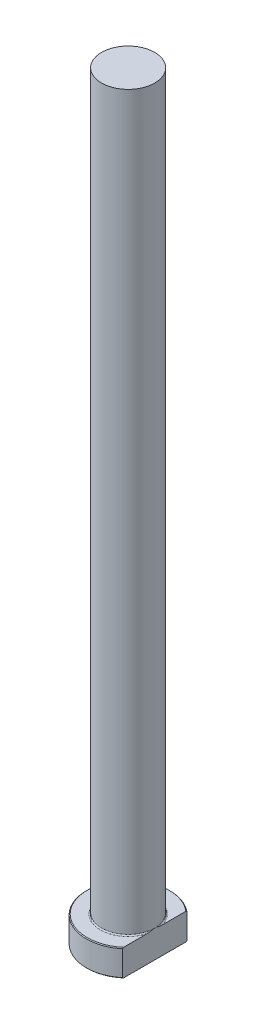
ISO-10303-21;
HEADER;
FILE_DESCRIPTION(('STEP AP214'),'2;1');
FILE_NAME('part.step','',(''),(''),'','','');
FILE_SCHEMA(('AUTOMOTIVE_DESIGN { 1 0 10303 214 1 1 1 1 }'));
ENDSEC;
DATA;
#1=APPLICATION_CONTEXT('core data for automotive mechanical design processes');
#2=APPLICATION_PROTOCOL_DEFINITION('international standard','automotive_design',2000,#1);
#3=PRODUCT_CONTEXT('',#1,'mechanical');
#4=PRODUCT('Part','Part','',(#3));
#5=PRODUCT_RELATED_PRODUCT_CATEGORY('part','',(#4));
#6=PRODUCT_DEFINITION_FORMATION('','',#4);
#7=PRODUCT_DEFINITION_CONTEXT('part definition',#1,'design');
#8=PRODUCT_DEFINITION('design','',#6,#7);
#9=PRODUCT_DEFINITION_SHAPE('','',#8);
#10=(LENGTH_UNIT() NAMED_UNIT(*) SI_UNIT(.MILLI.,.METRE.));
#11=(NAMED_UNIT(*) PLANE_ANGLE_UNIT() SI_UNIT($,.RADIAN.));
#12=(NAMED_UNIT(*) SI_UNIT($,.STERADIAN.) SOLID_ANGLE_UNIT());
#13=UNCERTAINTY_MEASURE_WITH_UNIT(LENGTH_MEASURE(1.E-05),#10,'distance_accuracy_value','');
#14=(GEOMETRIC_REPRESENTATION_CONTEXT(3) GLOBAL_UNCERTAINTY_ASSIGNED_CONTEXT((#13)) GLOBAL_UNIT_ASSIGNED_CONTEXT((#10,
#11,#12)) REPRESENTATION_CONTEXT('',''));
#15=CARTESIAN_POINT('',(0.,0.,0.));
#16=DIRECTION('',(0.,0.,1.));
#17=DIRECTION('',(1.,0.,0.));
#18=AXIS2_PLACEMENT_3D('',#15,#16,#17);
#19=CARTESIAN_POINT('',(0.,0.,0.));
#20=DIRECTION('',(0.,-1.,0.));
#21=DIRECTION('',(0.,0.,-1.));
#22=AXIS2_PLACEMENT_3D('',#19,#20,#21);
#23=PLANE('',#22);
#24=CARTESIAN_POINT('',(0.,0.,0.));
#25=DIRECTION('',(0.,-1.,0.));
#26=DIRECTION('',(0.,0.,-1.));
#27=AXIS2_PLACEMENT_3D('',#24,#25,#26);
#28=CIRCLE('',#27,10.7999999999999);
#29=CARTESIAN_POINT('',(6.99999999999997,0.,8.2243540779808));
#30=VERTEX_POINT('',#29);
#31=CARTESIAN_POINT('',(6.99999999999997,0.,-8.2243540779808));
#32=VERTEX_POINT('',#31);
#33=EDGE_CURVE('E98',#30,#32,#28,.T.);
#34=ORIENTED_EDGE('',*,*,#33,.T.);
#35=DIRECTION('',(0.,0.,1.));
#36=VECTOR('',#35,1.);
#37=CARTESIAN_POINT('',(6.99999999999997,0.,-8.48528137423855));
#38=LINE('',#37,#36);
#39=EDGE_CURVE('E83',#32,#30,#38,.T.);
#40=ORIENTED_EDGE('',*,*,#39,.T.);
#41=EDGE_LOOP('',(#34,#40));
#42=FACE_BOUND('',#41,.T.);
#43=ADVANCED_FACE('F32',(#42),#23,.T.);
#44=CARTESIAN_POINT('',(0.,259.958771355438,0.));
#45=DIRECTION('',(0.,1.,0.));
#46=DIRECTION('',(0.,0.,1.));
#47=AXIS2_PLACEMENT_3D('',#44,#45,#46);
#48=CYLINDRICAL_SURFACE('',#47,11.);
#49=CARTESIAN_POINT('',(0.,6.79999999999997,0.));
#50=DIRECTION('',(0.,1.,0.));
#51=DIRECTION('',(0.,0.,1.));
#52=AXIS2_PLACEMENT_3D('',#49,#50,#51);
#53=CIRCLE('',#52,11.);
#54=CARTESIAN_POINT('',(6.99999999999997,6.79999999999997,8.48528137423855));
#55=VERTEX_POINT('',#54);
#56=CARTESIAN_POINT('',(6.99999999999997,6.79999999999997,-8.48528137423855));
#57=VERTEX_POINT('',#56);
#58=EDGE_CURVE('E104',#55,#57,#53,.F.);
#59=ORIENTED_EDGE('',*,*,#58,.T.);
#60=DIRECTION('',(0.,-1.,0.));
#61=VECTOR('',#60,1.);
#62=CARTESIAN_POINT('',(6.99999999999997,200.,-8.48528137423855));
#63=LINE('',#62,#61);
#64=CARTESIAN_POINT('',(6.99999999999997,0.200000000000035,-8.48528137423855));
#65=VERTEX_POINT('',#64);
#66=EDGE_CURVE('E183',#57,#65,#63,.T.);
#67=ORIENTED_EDGE('',*,*,#66,.T.);
#68=CARTESIAN_POINT('',(0.,0.200000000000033,0.));
#69=DIRECTION('',(0.,-1.,0.));
#70=DIRECTION('',(0.,0.,-1.));
#71=AXIS2_PLACEMENT_3D('',#68,#69,#70);
#72=CIRCLE('',#71,11.);
#73=CARTESIAN_POINT('',(6.99999999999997,0.200000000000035,8.48528137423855));
#74=VERTEX_POINT('',#73);
#75=EDGE_CURVE('E100',#65,#74,#72,.F.);
#76=ORIENTED_EDGE('',*,*,#75,.T.);
#77=DIRECTION('',(0.,-1.,0.));
#78=VECTOR('',#77,1.);
#79=CARTESIAN_POINT('',(6.99999999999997,200.,8.48528137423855));
#80=LINE('',#79,#78);
#81=EDGE_CURVE('E93',#55,#74,#80,.T.);
#82=ORIENTED_EDGE('',*,*,#81,.F.);
#83=EDGE_LOOP('',(#59,#67,#76,#82));
#84=FACE_BOUND('',#83,.T.);
#85=ADVANCED_FACE('F158',(#84),#48,.T.);
#86=CARTESIAN_POINT('',(-11.,7.,0.));
#87=DIRECTION('',(0.,1.,0.));
#88=DIRECTION('',(0.,0.,1.));
#89=AXIS2_PLACEMENT_3D('',#86,#87,#88);
#90=PLANE('',#89);
#91=CARTESIAN_POINT('',(0.,7.,0.));
#92=DIRECTION('',(0.,1.,0.));
#93=DIRECTION('',(0.,0.,1.));
#94=AXIS2_PLACEMENT_3D('',#91,#92,#93);
#95=CIRCLE('',#94,10.8);
#96=CARTESIAN_POINT('',(6.99999999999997,7.,-8.2243540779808));
#97=VERTEX_POINT('',#96);
#98=CARTESIAN_POINT('',(6.99999999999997,7.,8.2243540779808));
#99=VERTEX_POINT('',#98);
#100=EDGE_CURVE('E178',#97,#99,#95,.T.);
#101=ORIENTED_EDGE('',*,*,#100,.T.);
#102=DIRECTION('',(0.,0.,-1.));
#103=VECTOR('',#102,1.);
#104=CARTESIAN_POINT('',(6.99999999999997,7.,0.));
#105=LINE('',#104,#103);
#106=CARTESIAN_POINT('',(6.99999999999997,6.99999999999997,2.07123151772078));
#107=VERTEX_POINT('',#106);
#108=EDGE_CURVE('E57',#99,#107,#105,.T.);
#109=ORIENTED_EDGE('',*,*,#108,.T.);
#110=CARTESIAN_POINT('',(0.,7.,0.));
#111=DIRECTION('',(0.,1.,0.));
#112=DIRECTION('',(0.,0.,1.));
#113=AXIS2_PLACEMENT_3D('',#110,#111,#112);
#114=CIRCLE('',#113,7.29999999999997);
#115=CARTESIAN_POINT('',(6.99999999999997,6.99999999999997,-2.07123151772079));
#116=VERTEX_POINT('',#115);
#117=EDGE_CURVE('E107',#107,#116,#114,.F.);
#118=ORIENTED_EDGE('',*,*,#117,.T.);
#119=EDGE_CURVE('E136',#116,#97,#105,.T.);
#120=ORIENTED_EDGE('',*,*,#119,.T.);
#121=EDGE_LOOP('',(#101,#109,#118,#120));
#122=FACE_BOUND('',#121,.T.);
#123=ADVANCED_FACE('F147',(#122),#90,.T.);
#124=CARTESIAN_POINT('',(0.,7.00000000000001,0.));
#125=DIRECTION('',(0.,-1.,0.));
#126=DIRECTION('',(0.,0.,-1.));
#127=AXIS2_PLACEMENT_3D('',#124,#125,#126);
#128=CONICAL_SURFACE('',#127,10.7999999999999,0.785398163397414);
#129=ORIENTED_EDGE('',*,*,#58,.F.);
#130=CARTESIAN_POINT('',(6.99999999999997,-2.13774979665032,18.6685261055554));
#131=CARTESIAN_POINT('',(6.99999999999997,-1.8657487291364,18.3780244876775));
#132=CARTESIAN_POINT('',(6.99999999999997,-1.59415659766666,18.0871392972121));
#133=CARTESIAN_POINT('',(6.99999999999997,-1.05192877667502,17.5044755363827));
#134=CARTESIAN_POINT('',(6.99999999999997,-0.781293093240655,17.2126969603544));
#135=CARTESIAN_POINT('',(6.99999999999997,-0.241050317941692,16.628048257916));
#136=CARTESIAN_POINT('',(6.99999999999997,0.0285564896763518,16.3351778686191));
#137=CARTESIAN_POINT('',(6.99999999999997,0.566485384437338,15.7482616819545));
#138=CARTESIAN_POINT('',(6.99999999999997,0.834807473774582,15.4542158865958));
#139=CARTESIAN_POINT('',(6.99999999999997,1.64198377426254,14.5651645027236));
#140=CARTESIAN_POINT('',(6.99999999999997,2.17856420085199,13.9680841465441));
#141=CARTESIAN_POINT('',(6.99999999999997,2.97696333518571,13.06681441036));
#142=CARTESIAN_POINT('',(6.99999999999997,3.24199785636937,12.7654727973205));
#143=CARTESIAN_POINT('',(6.99999999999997,3.76945856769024,12.1605141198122));
#144=CARTESIAN_POINT('',(6.99999999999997,4.03188476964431,11.8568970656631));
#145=CARTESIAN_POINT('',(6.99999999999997,4.50733797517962,11.3009625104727));
#146=CARTESIAN_POINT('',(6.99999999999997,4.7208802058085,11.0490858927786));
#147=CARTESIAN_POINT('',(6.99999999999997,5.14538078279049,10.5431655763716));
#148=CARTESIAN_POINT('',(6.99999999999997,5.35633915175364,10.2891218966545));
#149=CARTESIAN_POINT('',(6.99999999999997,5.77522964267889,9.7783673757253));
#150=CARTESIAN_POINT('',(6.99999999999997,5.98316044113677,9.52165544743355));
#151=CARTESIAN_POINT('',(6.99999999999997,6.39521098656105,9.00519084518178));
#152=CARTESIAN_POINT('',(6.99999999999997,6.59933078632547,8.74543821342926));
#153=CARTESIAN_POINT('',(6.99999999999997,7.00243445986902,8.22283607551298));
#154=CARTESIAN_POINT('',(6.99999999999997,7.20142819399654,7.95999419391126));
#155=CARTESIAN_POINT('',(6.99999999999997,7.59353840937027,7.42991856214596));
#156=CARTESIAN_POINT('',(6.99999999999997,7.78665447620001,7.16268450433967));
#157=CARTESIAN_POINT('',(6.99999999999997,8.16523718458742,6.62311113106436));
#158=CARTESIAN_POINT('',(6.99999999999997,8.35070911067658,6.35077553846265));
#159=CARTESIAN_POINT('',(6.99999999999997,8.71189725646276,5.7997373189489));
#160=CARTESIAN_POINT('',(6.99999999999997,8.88761537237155,5.5210359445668));
#161=CARTESIAN_POINT('',(6.99999999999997,9.19554959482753,5.00707921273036));
#162=CARTESIAN_POINT('',(6.99999999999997,9.3298807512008,4.77309669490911));
#163=CARTESIAN_POINT('',(6.99999999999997,9.58764253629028,4.29911523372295));
#164=CARTESIAN_POINT('',(6.99999999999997,9.71107181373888,4.05911554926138));
#165=CARTESIAN_POINT('',(6.99999999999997,9.94390907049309,3.57263619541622));
#166=CARTESIAN_POINT('',(6.99999999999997,10.0533307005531,3.3261631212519));
#167=CARTESIAN_POINT('',(6.99999999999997,10.2545146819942,2.82607166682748));
#168=CARTESIAN_POINT('',(6.99999999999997,10.3462820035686,2.57245532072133));
#169=CARTESIAN_POINT('',(6.99999999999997,10.4907049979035,2.11254447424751));
#170=CARTESIAN_POINT('',(6.99999999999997,10.5475277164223,1.90756611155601));
#171=CARTESIAN_POINT('',(6.99999999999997,10.6452043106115,1.49381161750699));
#172=CARTESIAN_POINT('',(6.99999999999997,10.68606033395,1.2850360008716));
#173=CARTESIAN_POINT('',(6.99999999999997,10.749755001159,0.865342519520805));
#174=CARTESIAN_POINT('',(6.99999999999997,10.772646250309,0.654432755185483));
#175=CARTESIAN_POINT('',(6.99999999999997,10.7993569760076,0.231396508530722));
#176=CARTESIAN_POINT('',(6.99999999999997,10.8031771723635,0.0192700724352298));
#177=CARTESIAN_POINT('',(6.99999999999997,10.7915178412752,-0.404715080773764));
#178=CARTESIAN_POINT('',(6.99999999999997,10.7760135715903,-0.616573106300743));
#179=CARTESIAN_POINT('',(6.99999999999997,10.7265413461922,-1.03810446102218));
#180=CARTESIAN_POINT('',(6.99999999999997,10.6925718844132,-1.24777761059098));
#181=CARTESIAN_POINT('',(6.99999999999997,10.6077703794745,-1.66430273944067));
#182=CARTESIAN_POINT('',(6.99999999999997,10.5568873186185,-1.87114418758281));
#183=CARTESIAN_POINT('',(6.99999999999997,10.4404729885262,-2.28061279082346));
#184=CARTESIAN_POINT('',(6.99999999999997,10.3749414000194,-2.48323985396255));
#185=CARTESIAN_POINT('',(6.99999999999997,10.2190980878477,-2.91860265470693));
#186=CARTESIAN_POINT('',(6.99999999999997,10.1264616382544,-3.15050038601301));
#187=CARTESIAN_POINT('',(6.99999999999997,9.92740958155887,-3.60835455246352));
#188=CARTESIAN_POINT('',(6.99999999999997,9.8209876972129,-3.83430822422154));
#189=CARTESIAN_POINT('',(6.99999999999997,9.59695142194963,-4.28105341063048));
#190=CARTESIAN_POINT('',(6.99999999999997,9.47931762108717,-4.50183511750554));
#191=CARTESIAN_POINT('',(6.99999999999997,9.23524231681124,-4.93840249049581));
#192=CARTESIAN_POINT('',(6.99999999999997,9.10880204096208,-5.1541888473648));
#193=CARTESIAN_POINT('',(6.99999999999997,8.84714657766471,-5.58417945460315));
#194=CARTESIAN_POINT('',(6.99999999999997,8.71183920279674,-5.79832734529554));
#195=CARTESIAN_POINT('',(6.99999999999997,8.43533082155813,-6.22277635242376));
#196=CARTESIAN_POINT('',(6.99999999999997,8.29412966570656,-6.43307737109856));
#197=CARTESIAN_POINT('',(6.99999999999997,8.00706556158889,-6.85014007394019));
#198=CARTESIAN_POINT('',(6.99999999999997,7.86120763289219,-7.05690522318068));
#199=CARTESIAN_POINT('',(6.99999999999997,7.56553131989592,-7.46757278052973));
#200=CARTESIAN_POINT('',(6.99999999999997,7.41571298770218,-7.67147522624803));
#201=CARTESIAN_POINT('',(6.99999999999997,7.0799970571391,-8.12067189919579));
#202=CARTESIAN_POINT('',(6.99999999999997,6.89330819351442,-8.36537403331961));
#203=CARTESIAN_POINT('',(6.99999999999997,6.51597189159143,-8.85171196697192));
#204=CARTESIAN_POINT('',(6.99999999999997,6.32532432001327,-9.09334766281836));
#205=CARTESIAN_POINT('',(6.99999999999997,5.94076020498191,-9.57404667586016));
#206=CARTESIAN_POINT('',(6.99999999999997,5.74684327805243,-9.81310968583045));
#207=CARTESIAN_POINT('',(6.99999999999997,5.35630729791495,-10.2890203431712));
#208=CARTESIAN_POINT('',(6.99999999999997,5.15968820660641,-10.5258679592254));
#209=CARTESIAN_POINT('',(6.99999999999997,4.5660695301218,-11.2340330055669));
#210=CARTESIAN_POINT('',(6.99999999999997,4.16568148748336,-11.7025100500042));
#211=CARTESIAN_POINT('',(6.99999999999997,3.3584003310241,-12.6338245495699));
#212=CARTESIAN_POINT('',(6.99999999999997,2.95150704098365,-13.0966618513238));
#213=CARTESIAN_POINT('',(6.99999999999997,2.35017562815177,-13.7734103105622));
#214=CARTESIAN_POINT('',(6.99999999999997,2.15763812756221,-13.9890143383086));
#215=CARTESIAN_POINT('',(6.99999999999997,1.77161609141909,-14.4193671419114));
#216=CARTESIAN_POINT('',(6.99999999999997,1.57813157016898,-14.6341159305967));
#217=CARTESIAN_POINT('',(6.99999999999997,0.99641244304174,-15.277238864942));
#218=CARTESIAN_POINT('',(6.99999999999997,0.60692265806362,-15.704477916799));
#219=CARTESIAN_POINT('',(6.99999999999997,-0.173895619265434,-16.5556520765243));
#220=CARTESIAN_POINT('',(6.99999999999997,-0.565218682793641,-16.9795921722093));
#221=CARTESIAN_POINT('',(6.99999999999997,-1.34999931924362,-17.8254589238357));
#222=CARTESIAN_POINT('',(6.99999999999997,-1.74345679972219,-18.2473856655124));
#223=CARTESIAN_POINT('',(6.99999999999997,-2.13774979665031,-18.6685261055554));
#224=B_SPLINE_CURVE_WITH_KNOTS('',3,(#130,#131,#132,#133,#134,#135,#136,#137,#138,#139,#140,
#141,#142,#143,#144,#145,#146,#147,#148,#149,#150,#151,#152,#153,#154,#155,#156,#157,#158,#159,
#160,#161,#162,#163,#164,#165,#166,#167,#168,#169,#170,#171,#172,#173,#174,#175,#176,#177,#178,
#179,#180,#181,#182,#183,#184,#185,#186,#187,#188,#189,#190,#191,#192,#193,#194,#195,#196,#197,
#198,#199,#200,#201,#202,#203,#204,#205,#206,#207,#208,#209,#210,#211,#212,#213,#214,#215,#216,
#217,#218,#219,#220,#221,#222,#223),.UNSPECIFIED.,.F.,.F.,(4,2,2,2,2,2,2,2,2,2,2,2,2,2,2,2,2,2,
2,2,2,2,2,2,2,2,2,2,2,2,2,2,2,2,2,2,2,2,2,2,2,2,2,2,2,2,4),(0.,1.19389386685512,
2.38779531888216,3.58200567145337,4.77621398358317,7.18442154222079,8.38834194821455,
9.5922568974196,10.5828886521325,11.5735117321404,12.5645555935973,13.5555857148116,
14.5445404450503,15.5335647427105,16.5218934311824,17.5100293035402,18.3192088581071,
19.1284885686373,19.93697351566,20.7452305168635,21.3828127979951,22.0203092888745,
22.6559319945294,23.2915307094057,23.9279440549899,24.5644093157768,25.2028120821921,
25.8412287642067,26.589809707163,27.3387327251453,28.0889766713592,28.8391162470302,
29.5989369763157,30.3587769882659,31.1178239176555,31.876860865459,32.800165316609,
33.7235009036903,34.6469455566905,35.5704032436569,37.4191008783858,39.267848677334,
40.1350269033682,41.0021920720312,42.7365692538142,44.4673795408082,46.1981154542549),.UNSPECIFIED.);
#225=EDGE_CURVE('E135',#55,#99,#224,.T.);
#226=ORIENTED_EDGE('',*,*,#225,.T.);
#227=ORIENTED_EDGE('',*,*,#100,.F.);
#228=EDGE_CURVE('E127',#97,#57,#224,.T.);
#229=ORIENTED_EDGE('',*,*,#228,.T.);
#230=EDGE_LOOP('',(#129,#226,#227,#229));
#231=FACE_BOUND('',#230,.T.);
#232=ADVANCED_FACE('F143',(#231),#128,.T.);
#233=CARTESIAN_POINT('',(0.,0.200000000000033,0.));
#234=DIRECTION('',(0.,1.,0.));
#235=DIRECTION('',(0.,0.,1.));
#236=AXIS2_PLACEMENT_3D('',#233,#234,#235);
#237=CONICAL_SURFACE('',#236,11.,0.785398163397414);
#238=ORIENTED_EDGE('',*,*,#75,.F.);
#239=CARTESIAN_POINT('',(6.99999999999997,9.13774979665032,-18.6685261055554));
#240=CARTESIAN_POINT('',(6.99999999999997,8.86574872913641,-18.3780244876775));
#241=CARTESIAN_POINT('',(6.99999999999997,8.59415659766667,-18.0871392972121));
#242=CARTESIAN_POINT('',(6.99999999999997,8.05192877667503,-17.5044755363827));
#243=CARTESIAN_POINT('',(6.99999999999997,7.78129309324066,-17.2126969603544));
#244=CARTESIAN_POINT('',(6.99999999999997,7.2410503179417,-16.628048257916));
#245=CARTESIAN_POINT('',(6.99999999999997,6.97144351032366,-16.3351778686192));
#246=CARTESIAN_POINT('',(6.99999999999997,6.43351461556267,-15.7482616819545));
#247=CARTESIAN_POINT('',(6.99999999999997,6.16519252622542,-15.4542158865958));
#248=CARTESIAN_POINT('',(6.99999999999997,5.35801622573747,-14.5651645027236));
#249=CARTESIAN_POINT('',(6.99999999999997,4.82143579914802,-13.9680841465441));
#250=CARTESIAN_POINT('',(6.99999999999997,4.0230366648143,-13.06681441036));
#251=CARTESIAN_POINT('',(6.99999999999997,3.75800214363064,-12.7654727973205));
#252=CARTESIAN_POINT('',(6.99999999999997,3.23054143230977,-12.1605141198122));
#253=CARTESIAN_POINT('',(6.99999999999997,2.96811523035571,-11.8568970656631));
#254=CARTESIAN_POINT('',(6.99999999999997,2.49266202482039,-11.3009625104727));
#255=CARTESIAN_POINT('',(6.99999999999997,2.27911979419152,-11.0490858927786));
#256=CARTESIAN_POINT('',(6.99999999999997,1.85461921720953,-10.5431655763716));
#257=CARTESIAN_POINT('',(6.99999999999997,1.64366084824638,-10.2891218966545));
#258=CARTESIAN_POINT('',(6.99999999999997,1.22477035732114,-9.77836737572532));
#259=CARTESIAN_POINT('',(6.99999999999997,1.01683955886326,-9.52165544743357));
#260=CARTESIAN_POINT('',(6.99999999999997,0.60478901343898,-9.00519084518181));
#261=CARTESIAN_POINT('',(6.99999999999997,0.400669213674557,-8.74543821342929));
#262=CARTESIAN_POINT('',(6.99999999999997,-0.00243445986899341,-8.22283607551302));
#263=CARTESIAN_POINT('',(6.99999999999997,-0.201428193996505,-7.9599941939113));
#264=CARTESIAN_POINT('',(6.99999999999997,-0.593538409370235,-7.429918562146));
#265=CARTESIAN_POINT('',(6.99999999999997,-0.786654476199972,-7.16268450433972));
#266=CARTESIAN_POINT('',(6.99999999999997,-1.16523718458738,-6.62311113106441));
#267=CARTESIAN_POINT('',(6.99999999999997,-1.35070911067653,-6.35077553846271));
#268=CARTESIAN_POINT('',(6.99999999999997,-1.71189725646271,-5.79973731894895));
#269=CARTESIAN_POINT('',(6.99999999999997,-1.8876153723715,-5.52103594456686));
#270=CARTESIAN_POINT('',(6.99999999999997,-2.19554959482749,-5.00707921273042));
#271=CARTESIAN_POINT('',(6.99999999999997,-2.32988075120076,-4.77309669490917));
#272=CARTESIAN_POINT('',(6.99999999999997,-2.58764253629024,-4.29911523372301));
#273=CARTESIAN_POINT('',(6.99999999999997,-2.71107181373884,-4.05911554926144));
#274=CARTESIAN_POINT('',(6.99999999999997,-2.94390907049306,-3.57263619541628));
#275=CARTESIAN_POINT('',(6.99999999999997,-3.05333070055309,-3.32616312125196));
#276=CARTESIAN_POINT('',(6.99999999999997,-3.25451468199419,-2.82607166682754));
#277=CARTESIAN_POINT('',(6.99999999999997,-3.34628200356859,-2.57245532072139));
#278=CARTESIAN_POINT('',(6.99999999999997,-3.49070499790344,-2.11254447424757));
#279=CARTESIAN_POINT('',(6.99999999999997,-3.54752771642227,-1.90756611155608));
#280=CARTESIAN_POINT('',(6.99999999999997,-3.6452043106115,-1.49381161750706));
#281=CARTESIAN_POINT('',(6.99999999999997,-3.68606033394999,-1.28503600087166));
#282=CARTESIAN_POINT('',(6.99999999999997,-3.74975500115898,-0.865342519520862));
#283=CARTESIAN_POINT('',(6.99999999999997,-3.77264625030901,-0.65443275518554));
#284=CARTESIAN_POINT('',(6.99999999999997,-3.79935697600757,-0.231396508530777));
#285=CARTESIAN_POINT('',(6.99999999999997,-3.80317717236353,-0.0192700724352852));
#286=CARTESIAN_POINT('',(6.99999999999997,-3.79151784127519,0.404715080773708));
#287=CARTESIAN_POINT('',(6.99999999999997,-3.77601357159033,0.616573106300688));
#288=CARTESIAN_POINT('',(6.99999999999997,-3.7265413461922,1.03810446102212));
#289=CARTESIAN_POINT('',(6.99999999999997,-3.69257188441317,1.24777761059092));
#290=CARTESIAN_POINT('',(6.99999999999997,-3.60777037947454,1.66430273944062));
#291=CARTESIAN_POINT('',(6.99999999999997,-3.55688731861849,1.87114418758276));
#292=CARTESIAN_POINT('',(6.99999999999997,-3.44047298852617,2.28061279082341));
#293=CARTESIAN_POINT('',(6.99999999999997,-3.37494140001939,2.48323985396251));
#294=CARTESIAN_POINT('',(6.99999999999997,-3.21909808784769,2.91860265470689));
#295=CARTESIAN_POINT('',(6.99999999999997,-3.12646163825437,3.15050038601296));
#296=CARTESIAN_POINT('',(6.99999999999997,-2.92740958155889,3.60835455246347));
#297=CARTESIAN_POINT('',(6.99999999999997,-2.82098769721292,3.83430822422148));
#298=CARTESIAN_POINT('',(6.99999999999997,-2.59695142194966,4.28105341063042));
#299=CARTESIAN_POINT('',(6.99999999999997,-2.4793176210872,4.50183511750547));
#300=CARTESIAN_POINT('',(6.99999999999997,-2.23524231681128,4.93840249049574));
#301=CARTESIAN_POINT('',(6.99999999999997,-2.10880204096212,5.15418884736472));
#302=CARTESIAN_POINT('',(6.99999999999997,-1.84714657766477,5.58417945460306));
#303=CARTESIAN_POINT('',(6.99999999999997,-1.7118392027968,5.79832734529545));
#304=CARTESIAN_POINT('',(6.99999999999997,-1.43533082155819,6.22277635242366));
#305=CARTESIAN_POINT('',(6.99999999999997,-1.29412966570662,6.43307737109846));
#306=CARTESIAN_POINT('',(6.99999999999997,-1.00706556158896,6.85014007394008));
#307=CARTESIAN_POINT('',(6.99999999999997,-0.86120763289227,7.05690522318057));
#308=CARTESIAN_POINT('',(6.99999999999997,-0.565531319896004,7.46757278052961));
#309=CARTESIAN_POINT('',(6.99999999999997,-0.415712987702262,7.6714752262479));
#310=CARTESIAN_POINT('',(6.99999999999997,-0.0799970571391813,8.12067189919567));
#311=CARTESIAN_POINT('',(6.99999999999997,0.1066918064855,8.36537403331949));
#312=CARTESIAN_POINT('',(6.99999999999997,0.484028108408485,8.85171196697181));
#313=CARTESIAN_POINT('',(6.99999999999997,0.674675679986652,9.09334766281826));
#314=CARTESIAN_POINT('',(6.99999999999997,1.05923979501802,9.57404667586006));
#315=CARTESIAN_POINT('',(6.99999999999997,1.2531567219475,9.81310968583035));
#316=CARTESIAN_POINT('',(6.99999999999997,1.64369270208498,10.2890203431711));
#317=CARTESIAN_POINT('',(6.99999999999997,1.84031179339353,10.5258679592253));
#318=CARTESIAN_POINT('',(6.99999999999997,2.43393046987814,11.2340330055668));
#319=CARTESIAN_POINT('',(6.99999999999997,2.83431851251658,11.7025100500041));
#320=CARTESIAN_POINT('',(6.99999999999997,3.64159966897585,12.6338245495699));
#321=CARTESIAN_POINT('',(6.99999999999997,4.04849295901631,13.0966618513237));
#322=CARTESIAN_POINT('',(6.99999999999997,4.64982437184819,13.7734103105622));
#323=CARTESIAN_POINT('',(6.99999999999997,4.84236187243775,13.9890143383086));
#324=CARTESIAN_POINT('',(6.99999999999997,5.22838390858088,14.4193671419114));
#325=CARTESIAN_POINT('',(6.99999999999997,5.42186842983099,14.6341159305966));
#326=CARTESIAN_POINT('',(6.99999999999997,6.00358755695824,15.2772388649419));
#327=CARTESIAN_POINT('',(6.99999999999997,6.39307734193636,15.704477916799));
#328=CARTESIAN_POINT('',(6.99999999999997,7.17389561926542,16.5556520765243));
#329=CARTESIAN_POINT('',(6.99999999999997,7.56521868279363,16.9795921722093));
#330=CARTESIAN_POINT('',(6.99999999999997,8.34999931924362,17.8254589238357));
#331=CARTESIAN_POINT('',(6.99999999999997,8.74345679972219,18.2473856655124));
#332=CARTESIAN_POINT('',(6.99999999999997,9.13774979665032,18.6685261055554));
#333=B_SPLINE_CURVE_WITH_KNOTS('',3,(#239,#240,#241,#242,#243,#244,#245,#246,#247,#248,#249,
#250,#251,#252,#253,#254,#255,#256,#257,#258,#259,#260,#261,#262,#263,#264,#265,#266,#267,#268,
#269,#270,#271,#272,#273,#274,#275,#276,#277,#278,#279,#280,#281,#282,#283,#284,#285,#286,#287,
#288,#289,#290,#291,#292,#293,#294,#295,#296,#297,#298,#299,#300,#301,#302,#303,#304,#305,#306,
#307,#308,#309,#310,#311,#312,#313,#314,#315,#316,#317,#318,#319,#320,#321,#322,#323,#324,#325,
#326,#327,#328,#329,#330,#331,#332),.UNSPECIFIED.,.F.,.F.,(4,2,2,2,2,2,2,2,2,2,2,2,2,2,2,2,2,2,
2,2,2,2,2,2,2,2,2,2,2,2,2,2,2,2,2,2,2,2,2,2,2,2,2,2,2,2,4),(0.,1.19389386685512,
2.38779531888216,3.58200567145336,4.77621398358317,7.18442154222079,8.38834194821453,
9.59225689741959,10.5828886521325,11.5735117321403,12.5645555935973,13.5555857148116,
14.5445404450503,15.5335647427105,16.5218934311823,17.5100293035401,18.319208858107,
19.1284885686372,19.93697351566,20.7452305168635,21.382812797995,22.0203092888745,
22.6559319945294,23.2915307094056,23.9279440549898,24.5644093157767,25.2028120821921,
25.8412287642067,26.589809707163,27.3387327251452,28.0889766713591,28.8391162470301,
29.5989369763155,30.3587769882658,31.1178239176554,31.8768608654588,32.8001653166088,
33.7235009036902,34.6469455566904,35.5704032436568,37.4191008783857,39.2678486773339,
40.1350269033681,41.0021920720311,42.7365692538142,44.4673795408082,46.1981154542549),.UNSPECIFIED.);
#334=EDGE_CURVE('E86',#65,#32,#333,.T.);
#335=ORIENTED_EDGE('',*,*,#334,.T.);
#336=ORIENTED_EDGE('',*,*,#33,.F.);
#337=EDGE_CURVE('E89',#30,#74,#333,.T.);
#338=ORIENTED_EDGE('',*,*,#337,.T.);
#339=EDGE_LOOP('',(#238,#335,#336,#338));
#340=FACE_BOUND('',#339,.T.);
#341=ADVANCED_FACE('F97',(#340),#237,.T.);
#342=CARTESIAN_POINT('',(0.,7.29999999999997,0.));
#343=DIRECTION('',(0.,1.,0.));
#344=DIRECTION('',(0.,0.,1.));
#345=AXIS2_PLACEMENT_3D('',#342,#343,#344);
#346=TOROIDAL_SURFACE('',#345,7.29999999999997,0.3);
#347=CARTESIAN_POINT('',(6.99999999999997,7.29999999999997,0.));
#348=CARTESIAN_POINT('',(6.99999999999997,7.30000062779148,2.32628005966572E-11));
#349=CARTESIAN_POINT('',(6.99999999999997,7.30000125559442,-3.16909134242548E-07));
#350=CARTESIAN_POINT('',(6.99999999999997,7.30000241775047,-1.14637029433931E-06));
#351=CARTESIAN_POINT('',(6.99999999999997,7.30000292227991,-1.68168827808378E-06));
#352=CARTESIAN_POINT('',(6.99999999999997,7.30000400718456,-2.97869768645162E-06));
#353=CARTESIAN_POINT('',(6.99999999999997,7.30000456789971,-3.76131367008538E-06));
#354=CARTESIAN_POINT('',(6.99999999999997,7.30000553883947,-5.35167977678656E-06));
#355=CARTESIAN_POINT('',(6.99999999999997,7.30000595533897,-6.15604635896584E-06));
#356=CARTESIAN_POINT('',(6.99999999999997,7.30000758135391,-9.388029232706E-06));
#357=CARTESIAN_POINT('',(6.99999999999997,7.30000871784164,-1.18573464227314E-05));
#358=CARTESIAN_POINT('',(6.99999999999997,7.30001050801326,-1.66549715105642E-05));
#359=CARTESIAN_POINT('',(6.99999999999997,7.30001120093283,-1.89691200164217E-05));
#360=CARTESIAN_POINT('',(6.99999999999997,7.30001423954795,-2.9073526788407E-05));
#361=CARTESIAN_POINT('',(6.99999999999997,7.30001661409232,-3.68567169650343E-05));
#362=CARTESIAN_POINT('',(6.99999999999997,7.30001997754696,-5.13387672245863E-05));
#363=CARTESIAN_POINT('',(6.99999999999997,7.30002113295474,-5.79981986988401E-05));
#364=CARTESIAN_POINT('',(6.99999999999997,7.30002974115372,-0.000108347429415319));
#365=CARTESIAN_POINT('',(6.99999999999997,7.30003649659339,-0.000152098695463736));
#366=CARTESIAN_POINT('',(6.99999999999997,7.30006604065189,-0.000326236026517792));
#367=CARTESIAN_POINT('',(6.99999999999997,7.30009398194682,-0.000455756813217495));
#368=CARTESIAN_POINT('',(6.99999999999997,7.30020370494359,-0.000971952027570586));
#369=CARTESIAN_POINT('',(6.99999999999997,7.30028233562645,-0.00135905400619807));
#370=CARTESIAN_POINT('',(6.99999999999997,7.30059908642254,-0.00290811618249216));
#371=CARTESIAN_POINT('',(6.99999999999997,7.30084128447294,-0.00406949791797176));
#372=CARTESIAN_POINT('',(6.99999999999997,7.30185637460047,-0.00894870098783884));
#373=CARTESIAN_POINT('',(6.99999999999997,7.30262406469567,-0.0126672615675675));
#374=CARTESIAN_POINT('',(6.99999999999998,7.30904362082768,-0.0437472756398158));
#375=CARTESIAN_POINT('',(6.99999999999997,7.31471492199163,-0.0711060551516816));
#376=CARTESIAN_POINT('',(6.99999999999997,7.3257989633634,-0.124711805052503));
#377=CARTESIAN_POINT('',(6.99999999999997,7.33121280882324,-0.150958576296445));
#378=CARTESIAN_POINT('',(6.99999999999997,7.34888721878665,-0.236855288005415));
#379=CARTESIAN_POINT('',(6.99999999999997,7.36109504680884,-0.296516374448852));
#380=CARTESIAN_POINT('',(6.99999999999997,7.38163193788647,-0.398125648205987));
#381=CARTESIAN_POINT('',(6.99999999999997,7.39003371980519,-0.440059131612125));
#382=CARTESIAN_POINT('',(6.99999999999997,7.40641913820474,-0.522820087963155));
#383=CARTESIAN_POINT('',(6.99999999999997,7.41440792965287,-0.563646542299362));
#384=CARTESIAN_POINT('',(6.99999999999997,7.44025584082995,-0.697745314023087));
#385=CARTESIAN_POINT('',(6.99999999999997,7.45763052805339,-0.791112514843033));
#386=CARTESIAN_POINT('',(6.99999999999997,7.4907040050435,-0.979068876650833));
#387=CARTESIAN_POINT('',(6.99999999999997,7.50638514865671,-1.07366117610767));
#388=CARTESIAN_POINT('',(6.99999999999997,7.53649600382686,-1.27237182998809));
#389=CARTESIAN_POINT('',(6.99999999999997,7.55066037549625,-1.37653153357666));
#390=CARTESIAN_POINT('',(6.99999999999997,7.57450660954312,-1.58508707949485));
#391=CARTESIAN_POINT('',(6.99999999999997,7.58420070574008,-1.68948148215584));
#392=CARTESIAN_POINT('',(6.99999999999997,7.5971656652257,-1.89515538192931));
#393=CARTESIAN_POINT('',(6.99999999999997,7.60064432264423,-1.9964196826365));
#394=CARTESIAN_POINT('',(6.99999999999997,7.59954163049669,-2.14745317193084));
#395=CARTESIAN_POINT('',(6.99999999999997,7.59815772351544,-2.19724153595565));
#396=CARTESIAN_POINT('',(6.99999999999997,7.59283451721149,-2.29666246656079));
#397=CARTESIAN_POINT('',(6.99999999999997,7.58889656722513,-2.34629510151));
#398=CARTESIAN_POINT('',(6.99999999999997,7.57769755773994,-2.44571674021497));
#399=CARTESIAN_POINT('',(6.99999999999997,7.57040396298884,-2.49550242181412));
#400=CARTESIAN_POINT('',(6.99999999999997,7.5560244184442,-2.56951537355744));
#401=CARTESIAN_POINT('',(6.99999999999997,7.55065780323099,-2.59407625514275));
#402=CARTESIAN_POINT('',(6.99999999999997,7.53852479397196,-2.642845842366));
#403=CARTESIAN_POINT('',(6.99999999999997,7.53175908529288,-2.66705471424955));
#404=CARTESIAN_POINT('',(6.99999999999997,7.5174892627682,-2.71174649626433));
#405=CARTESIAN_POINT('',(6.99999999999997,7.510201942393,-2.73229789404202));
#406=CARTESIAN_POINT('',(6.99999999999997,7.4939308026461,-2.77282387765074));
#407=CARTESIAN_POINT('',(6.99999999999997,7.4849410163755,-2.79279614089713));
#408=CARTESIAN_POINT('',(6.99999999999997,7.46462265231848,-2.83190553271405));
#409=CARTESIAN_POINT('',(6.99999999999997,7.45326134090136,-2.85102586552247));
#410=CARTESIAN_POINT('',(6.99999999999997,7.4274542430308,-2.88704231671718));
#411=CARTESIAN_POINT('',(6.99999999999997,7.41303489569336,-2.90395561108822));
#412=CARTESIAN_POINT('',(6.99999999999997,7.39049681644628,-2.92384155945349));
#413=CARTESIAN_POINT('',(6.99999999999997,7.3841904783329,-2.92884725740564));
#414=CARTESIAN_POINT('',(6.99999999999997,7.3709718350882,-2.9380049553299));
#415=CARTESIAN_POINT('',(6.99999999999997,7.36405938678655,-2.94215675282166));
#416=CARTESIAN_POINT('',(6.99999999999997,7.34956926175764,-2.94936604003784));
#417=CARTESIAN_POINT('',(6.99999999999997,7.34198467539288,-2.95240998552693));
#418=CARTESIAN_POINT('',(6.99999999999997,7.32637763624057,-2.95700924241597));
#419=CARTESIAN_POINT('',(6.99999999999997,7.31835605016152,-2.95856739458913));
#420=CARTESIAN_POINT('',(6.99999999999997,7.3029104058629,-2.95992508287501));
#421=CARTESIAN_POINT('',(6.99999999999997,7.29549953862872,-2.95987367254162));
#422=CARTESIAN_POINT('',(6.99999999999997,7.28081803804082,-2.95838504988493));
#423=CARTESIAN_POINT('',(6.99999999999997,7.27354749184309,-2.95694700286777));
#424=CARTESIAN_POINT('',(6.99999999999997,7.25853285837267,-2.95260391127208));
#425=CARTESIAN_POINT('',(6.99999999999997,7.25083383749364,-2.94954604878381));
#426=CARTESIAN_POINT('',(6.99999999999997,7.23603628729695,-2.9422241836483));
#427=CARTESIAN_POINT('',(6.99999999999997,7.22893877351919,-2.93795819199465));
#428=CARTESIAN_POINT('',(6.99999999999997,7.21163875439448,-2.92593351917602));
#429=CARTESIAN_POINT('',(6.99999999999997,7.20187862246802,-2.91754511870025));
#430=CARTESIAN_POINT('',(6.99999999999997,7.18370674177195,-2.89942475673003));
#431=CARTESIAN_POINT('',(6.99999999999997,7.17529892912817,-2.88968902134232));
#432=CARTESIAN_POINT('',(6.99999999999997,7.15199560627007,-2.85953893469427));
#433=CARTESIAN_POINT('',(6.99999999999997,7.13869481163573,-2.83790736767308));
#434=CARTESIAN_POINT('',(6.99999999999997,7.11507068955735,-2.79314645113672));
#435=CARTESIAN_POINT('',(6.99999999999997,7.10475206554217,-2.77001480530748));
#436=CARTESIAN_POINT('',(6.99999999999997,7.08155610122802,-2.7108784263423));
#437=CARTESIAN_POINT('',(6.99999999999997,7.07006528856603,-2.67433519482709));
#438=CARTESIAN_POINT('',(6.99999999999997,7.05044959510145,-2.60033159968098));
#439=CARTESIAN_POINT('',(6.99999999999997,7.04233234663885,-2.5628693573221));
#440=CARTESIAN_POINT('',(6.99999999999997,7.02853576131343,-2.48688638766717));
#441=CARTESIAN_POINT('',(6.99999999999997,7.02289758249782,-2.4483583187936));
#442=CARTESIAN_POINT('',(6.99999999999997,7.01369461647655,-2.37112071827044));
#443=CARTESIAN_POINT('',(6.99999999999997,7.01012698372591,-2.33241150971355));
#444=CARTESIAN_POINT('',(6.99999999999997,7.00239886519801,-2.22280038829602));
#445=CARTESIAN_POINT('',(6.99999999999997,7.00019016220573,-2.15176184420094));
#446=CARTESIAN_POINT('',(6.99999999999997,6.99983406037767,-2.0096618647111));
#447=CARTESIAN_POINT('',(6.99999999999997,7.00168936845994,-1.9386004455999));
#448=CARTESIAN_POINT('',(6.99999999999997,7.00854815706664,-1.79630907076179));
#449=CARTESIAN_POINT('',(6.99999999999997,7.01356610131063,-1.7250798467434));
#450=CARTESIAN_POINT('',(6.99999999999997,7.02608998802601,-1.5828366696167));
#451=CARTESIAN_POINT('',(6.99999999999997,7.03359634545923,-1.51182275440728));
#452=CARTESIAN_POINT('',(6.99999999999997,7.0575822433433,-1.31152735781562));
#453=CARTESIAN_POINT('',(6.99999999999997,7.07635481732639,-1.18252326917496));
#454=CARTESIAN_POINT('',(6.99999999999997,7.11790553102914,-0.926646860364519));
#455=CARTESIAN_POINT('',(6.99999999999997,7.14063741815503,-0.799766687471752));
#456=CARTESIAN_POINT('',(6.99999999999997,7.17322033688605,-0.627620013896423));
#457=CARTESIAN_POINT('',(6.99999999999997,7.18199317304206,-0.582145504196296));
#458=CARTESIAN_POINT('',(6.99999999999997,7.20004716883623,-0.489938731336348));
#459=CARTESIAN_POINT('',(6.99999999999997,7.20933569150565,-0.443207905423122));
#460=CARTESIAN_POINT('',(6.99999999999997,7.22546843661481,-0.362914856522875));
#461=CARTESIAN_POINT('',(6.99999999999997,7.23226586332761,-0.329343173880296));
#462=CARTESIAN_POINT('',(6.99999999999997,7.24586025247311,-0.262588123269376));
#463=CARTESIAN_POINT('',(6.99999999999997,7.25265638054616,-0.22940458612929));
#464=CARTESIAN_POINT('',(6.99999999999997,7.26550614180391,-0.166874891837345));
#465=CARTESIAN_POINT('',(6.99999999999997,7.27155497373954,-0.137527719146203));
#466=CARTESIAN_POINT('',(6.99999999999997,7.28394498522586,-0.0775831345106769));
#467=CARTESIAN_POINT('',(6.99999999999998,7.29028759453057,-0.0469859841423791));
#468=CARTESIAN_POINT('',(6.99999999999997,7.29737625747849,-0.0126656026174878));
#469=CARTESIAN_POINT('',(6.99999999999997,7.29814430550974,-0.00894538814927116));
#470=CARTESIAN_POINT('',(6.99999999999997,7.29915947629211,-0.00406582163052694));
#471=CARTESIAN_POINT('',(6.99999999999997,7.29940140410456,-0.00290573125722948));
#472=CARTESIAN_POINT('',(6.99999999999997,7.29971782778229,-0.00135826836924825));
#473=CARTESIAN_POINT('',(6.99999999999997,7.29979639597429,-0.000971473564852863));
#474=CARTESIAN_POINT('',(6.99999999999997,7.29990604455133,-0.000455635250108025));
#475=CARTESIAN_POINT('',(6.99999999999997,7.2999339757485,-0.00032616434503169));
#476=CARTESIAN_POINT('',(6.99999999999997,7.29996351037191,-0.000152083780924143));
#477=CARTESIAN_POINT('',(6.99999999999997,7.29997026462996,-0.000108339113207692));
#478=CARTESIAN_POINT('',(6.99999999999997,7.29997887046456,-5.7996672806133E-05));
#479=CARTESIAN_POINT('',(6.99999999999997,7.29998002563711,-5.13375704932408E-05));
#480=CARTESIAN_POINT('',(6.99999999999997,7.29998338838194,-3.6856228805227E-05));
#481=CARTESIAN_POINT('',(6.99999999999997,7.29998576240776,-2.90734013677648E-05));
#482=CARTESIAN_POINT('',(6.99999999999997,7.29998880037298,-1.8969379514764E-05));
#483=CARTESIAN_POINT('',(6.99999999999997,7.29998949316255,-1.6655255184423E-05));
#484=CARTESIAN_POINT('',(6.99999999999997,7.29999128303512,-1.18576604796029E-05));
#485=CARTESIAN_POINT('',(6.99999999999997,7.29999241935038,-9.38834597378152E-06));
#486=CARTESIAN_POINT('',(6.99999999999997,7.29999404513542,-6.15634598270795E-06));
#487=CARTESIAN_POINT('',(6.99999999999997,7.29999446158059,-5.35196743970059E-06));
#488=CARTESIAN_POINT('',(6.99999999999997,7.29999543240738,-3.76156762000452E-06));
#489=CARTESIAN_POINT('',(6.99999999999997,7.29999599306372,-2.97892931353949E-06));
#490=CARTESIAN_POINT('',(6.99999999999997,7.29999707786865,-1.68186918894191E-06));
#491=CARTESIAN_POINT('',(6.99999999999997,7.29999758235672,-1.14652503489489E-06));
#492=CARTESIAN_POINT('',(6.99999999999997,7.2999987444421,-3.16995271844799E-07));
#493=CARTESIAN_POINT('',(6.99999999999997,7.29999937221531,-2.32625469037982E-11));
#494=CARTESIAN_POINT('',(6.99999999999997,7.29999999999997,0.));
#495=B_SPLINE_CURVE_WITH_KNOTS('',3,(#347,#348,#349,#350,#351,#352,#353,#354,#355,#356,#357,
#358,#359,#360,#361,#362,#363,#364,#365,#366,#367,#368,#369,#370,#371,#372,#373,#374,#375,#376,
#377,#378,#379,#380,#381,#382,#383,#384,#385,#386,#387,#388,#389,#390,#391,#392,#393,#394,#395,
#396,#397,#398,#399,#400,#401,#402,#403,#404,#405,#406,#407,#408,#409,#410,#411,#412,#413,#414,
#415,#416,#417,#418,#419,#420,#421,#422,#423,#424,#425,#426,#427,#428,#429,#430,#431,#432,#433,
#434,#435,#436,#437,#438,#439,#440,#441,#442,#443,#444,#445,#446,#447,#448,#449,#450,#451,#452,
#453,#454,#455,#456,#457,#458,#459,#460,#461,#462,#463,#464,#465,#466,#467,#468,#469,#470,#471,
#472,#473,#474,#475,#476,#477,#478,#479,#480,#481,#482,#483,#484,#485,#486,#487,#488,#489,#490,
#491,#492,#493,#494),.UNSPECIFIED.,.T.,.F.,(4,2,2,2,2,2,2,2,2,2,2,2,2,2,2,2,2,2,2,2,2,2,2,2,2,2,
2,2,2,2,2,2,2,2,2,2,2,2,2,2,2,2,2,2,2,2,2,2,2,2,2,2,2,2,2,2,2,2,2,2,2,2,2,2,2,2,2,2,2,2,2,2,2,
4),(0.,1.92694204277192E-06,4.154269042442E-06,7.01948468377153E-06,9.73677790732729E-06,
1.78669784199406E-05,2.510708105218E-05,4.94892168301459E-05,6.97447136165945E-05,
0.000202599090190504,0.000599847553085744,0.00178514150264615,0.00534391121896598,
0.0167352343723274,0.100554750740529,0.180953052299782,0.36364407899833,0.491944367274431,
0.616746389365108,0.901643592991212,1.18926961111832,1.50455392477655,1.81897020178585,
2.12266301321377,2.27203455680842,2.42132724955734,2.57209897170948,2.64748997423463,
2.72284413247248,2.7882086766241,2.85380670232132,2.92037838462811,2.98639639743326,
3.01049823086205,3.03460577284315,3.05899886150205,3.08334521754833,3.10544427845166,
3.12755665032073,3.15227309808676,3.17703047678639,3.21542082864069,3.25392097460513,
3.32967543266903,3.4055487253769,3.52018968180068,3.63508860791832,3.75182904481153,
3.86840866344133,4.08144496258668,4.29462320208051,4.5087835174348,4.72297956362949,
5.11393929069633,5.50060554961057,5.63954426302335,5.78247850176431,5.8852372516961,
5.98685401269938,6.07674665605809,6.17048759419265,6.18188399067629,6.18543880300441,
6.18662315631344,6.18702025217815,6.18715308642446,6.18717334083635,6.18719772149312,
6.18720496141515,6.18721309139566,6.1872158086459,6.18721867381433,6.18722090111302,
6.18722282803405),.UNSPECIFIED.);
#496=CARTESIAN_POINT('',(6.99999999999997,7.29999999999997,0.));
#497=VERTEX_POINT('',#496);
#498=EDGE_CURVE('E11',#116,#497,#495,.T.);
#499=ORIENTED_EDGE('',*,*,#498,.F.);
#500=ORIENTED_EDGE('',*,*,#117,.F.);
#501=CARTESIAN_POINT('',(6.99999999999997,7.29999999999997,0.));
#502=CARTESIAN_POINT('',(6.99999999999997,7.29999937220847,-2.32626743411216E-11));
#503=CARTESIAN_POINT('',(6.99999999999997,7.29999874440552,3.16909134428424E-07));
#504=CARTESIAN_POINT('',(6.99999999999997,7.29999758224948,1.14637029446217E-06));
#505=CARTESIAN_POINT('',(6.99999999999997,7.29999707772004,1.68168827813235E-06));
#506=CARTESIAN_POINT('',(6.99999999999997,7.29999599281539,2.97869768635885E-06));
#507=CARTESIAN_POINT('',(6.99999999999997,7.29999543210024,3.76131366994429E-06));
#508=CARTESIAN_POINT('',(6.99999999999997,7.29999446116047,5.35167977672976E-06));
#509=CARTESIAN_POINT('',(6.99999999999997,7.29999404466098,6.15604635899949E-06));
#510=CARTESIAN_POINT('',(6.99999999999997,7.29999241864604,9.38802923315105E-06));
#511=CARTESIAN_POINT('',(6.99999999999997,7.29999128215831,1.18573464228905E-05));
#512=CARTESIAN_POINT('',(6.99999999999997,7.29998949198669,1.66549715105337E-05));
#513=CARTESIAN_POINT('',(6.99999999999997,7.29998879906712,1.8969120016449E-05));
#514=CARTESIAN_POINT('',(6.99999999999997,7.29998576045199,2.90735267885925E-05));
#515=CARTESIAN_POINT('',(6.99999999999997,7.29998338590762,3.68567169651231E-05));
#516=CARTESIAN_POINT('',(6.99999999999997,7.29998002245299,5.13387672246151E-05));
#517=CARTESIAN_POINT('',(6.99999999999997,7.2999788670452,5.7998198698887E-05));
#518=CARTESIAN_POINT('',(6.99999999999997,7.29997025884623,0.00010834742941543));
#519=CARTESIAN_POINT('',(6.99999999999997,7.29996350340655,0.000152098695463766));
#520=CARTESIAN_POINT('',(6.99999999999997,7.29993395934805,0.000326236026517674));
#521=CARTESIAN_POINT('',(6.99999999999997,7.29990601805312,0.000455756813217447));
#522=CARTESIAN_POINT('',(6.99999999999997,7.29979629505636,0.0009719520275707));
#523=CARTESIAN_POINT('',(6.99999999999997,7.2997176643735,0.00135905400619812));
#524=CARTESIAN_POINT('',(6.99999999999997,7.29940091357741,0.00290811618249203));
#525=CARTESIAN_POINT('',(6.99999999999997,7.29915871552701,0.0040694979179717));
#526=CARTESIAN_POINT('',(6.99999999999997,7.29814362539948,0.00894870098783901));
#527=CARTESIAN_POINT('',(6.99999999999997,7.29737593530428,0.0126672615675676));
#528=CARTESIAN_POINT('',(6.99999999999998,7.29095637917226,0.0437472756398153));
#529=CARTESIAN_POINT('',(6.99999999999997,7.28528507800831,0.0711060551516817));
#530=CARTESIAN_POINT('',(6.99999999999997,7.27420103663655,0.124711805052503));
#531=CARTESIAN_POINT('',(6.99999999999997,7.2687871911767,0.150958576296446));
#532=CARTESIAN_POINT('',(6.99999999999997,7.25111278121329,0.236855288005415));
#533=CARTESIAN_POINT('',(6.99999999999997,7.23890495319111,0.296516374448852));
#534=CARTESIAN_POINT('',(6.99999999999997,7.21836806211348,0.398125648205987));
#535=CARTESIAN_POINT('',(6.99999999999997,7.20996628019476,0.440059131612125));
#536=CARTESIAN_POINT('',(6.99999999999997,7.1935808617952,0.522820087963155));
#537=CARTESIAN_POINT('',(6.99999999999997,7.18559207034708,0.563646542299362));
#538=CARTESIAN_POINT('',(6.99999999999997,7.15974415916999,0.697745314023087));
#539=CARTESIAN_POINT('',(6.99999999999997,7.14236947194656,0.791112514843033));
#540=CARTESIAN_POINT('',(6.99999999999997,7.10929599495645,0.979068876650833));
#541=CARTESIAN_POINT('',(6.99999999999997,7.09361485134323,1.07366117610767));
#542=CARTESIAN_POINT('',(6.99999999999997,7.06350399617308,1.27237182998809));
#543=CARTESIAN_POINT('',(6.99999999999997,7.04933962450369,1.37653153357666));
#544=CARTESIAN_POINT('',(6.99999999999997,7.02549339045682,1.58508707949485));
#545=CARTESIAN_POINT('',(6.99999999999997,7.01579929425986,1.68948148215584));
#546=CARTESIAN_POINT('',(6.99999999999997,7.00283433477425,1.89515538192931));
#547=CARTESIAN_POINT('',(6.99999999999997,6.99935567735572,1.9964196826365));
#548=CARTESIAN_POINT('',(6.99999999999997,7.00045836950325,2.14745317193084));
#549=CARTESIAN_POINT('',(6.99999999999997,7.0018422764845,2.19724153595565));
#550=CARTESIAN_POINT('',(6.99999999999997,7.00716548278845,2.29666246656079));
#551=CARTESIAN_POINT('',(6.99999999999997,7.01110343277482,2.34629510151));
#552=CARTESIAN_POINT('',(6.99999999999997,7.02230244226,2.44571674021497));
#553=CARTESIAN_POINT('',(6.99999999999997,7.02959603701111,2.49550242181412));
#554=CARTESIAN_POINT('',(6.99999999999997,7.04397558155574,2.56951537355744));
#555=CARTESIAN_POINT('',(6.99999999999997,7.04934219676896,2.59407625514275));
#556=CARTESIAN_POINT('',(6.99999999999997,7.06147520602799,2.642845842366));
#557=CARTESIAN_POINT('',(6.99999999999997,7.06824091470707,2.66705471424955));
#558=CARTESIAN_POINT('',(6.99999999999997,7.08251073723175,2.71174649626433));
#559=CARTESIAN_POINT('',(6.99999999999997,7.08979805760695,2.73229789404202));
#560=CARTESIAN_POINT('',(6.99999999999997,7.10606919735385,2.77282387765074));
#561=CARTESIAN_POINT('',(6.99999999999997,7.11505898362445,2.79279614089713));
#562=CARTESIAN_POINT('',(6.99999999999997,7.13537734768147,2.83190553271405));
#563=CARTESIAN_POINT('',(6.99999999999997,7.14673865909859,2.85102586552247));
#564=CARTESIAN_POINT('',(6.99999999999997,7.17254575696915,2.88704231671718));
#565=CARTESIAN_POINT('',(6.99999999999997,7.18696510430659,2.90395561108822));
#566=CARTESIAN_POINT('',(6.99999999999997,7.20950318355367,2.92384155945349));
#567=CARTESIAN_POINT('',(6.99999999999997,7.21580952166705,2.92884725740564));
#568=CARTESIAN_POINT('',(6.99999999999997,7.22902816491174,2.9380049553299));
#569=CARTESIAN_POINT('',(6.99999999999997,7.2359406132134,2.94215675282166));
#570=CARTESIAN_POINT('',(6.99999999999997,7.2504307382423,2.94936604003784));
#571=CARTESIAN_POINT('',(6.99999999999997,7.25801532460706,2.95240998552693));
#572=CARTESIAN_POINT('',(6.99999999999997,7.27362236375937,2.95700924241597));
#573=CARTESIAN_POINT('',(6.99999999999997,7.28164394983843,2.95856739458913));
#574=CARTESIAN_POINT('',(6.99999999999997,7.29708959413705,2.95992508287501));
#575=CARTESIAN_POINT('',(6.99999999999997,7.30450046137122,2.95987367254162));
#576=CARTESIAN_POINT('',(6.99999999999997,7.31918196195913,2.95838504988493));
#577=CARTESIAN_POINT('',(6.99999999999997,7.32645250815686,2.95694700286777));
#578=CARTESIAN_POINT('',(6.99999999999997,7.34146714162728,2.95260391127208));
#579=CARTESIAN_POINT('',(6.99999999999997,7.34916616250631,2.94954604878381));
#580=CARTESIAN_POINT('',(6.99999999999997,7.363963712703,2.9422241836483));
#581=CARTESIAN_POINT('',(6.99999999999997,7.37106122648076,2.93795819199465));
#582=CARTESIAN_POINT('',(6.99999999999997,7.38836124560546,2.92593351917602));
#583=CARTESIAN_POINT('',(6.99999999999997,7.39812137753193,2.91754511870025));
#584=CARTESIAN_POINT('',(6.99999999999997,7.416293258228,2.89942475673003));
#585=CARTESIAN_POINT('',(6.99999999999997,7.42470107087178,2.88968902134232));
#586=CARTESIAN_POINT('',(6.99999999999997,7.44800439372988,2.85953893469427));
#587=CARTESIAN_POINT('',(6.99999999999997,7.46130518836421,2.83790736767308));
#588=CARTESIAN_POINT('',(6.99999999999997,7.4849293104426,2.79314645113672));
#589=CARTESIAN_POINT('',(6.99999999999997,7.49524793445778,2.77001480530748));
#590=CARTESIAN_POINT('',(6.99999999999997,7.51844389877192,2.7108784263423));
#591=CARTESIAN_POINT('',(6.99999999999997,7.52993471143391,2.67433519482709));
#592=CARTESIAN_POINT('',(6.99999999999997,7.5495504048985,2.60033159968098));
#593=CARTESIAN_POINT('',(6.99999999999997,7.55766765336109,2.5628693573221));
#594=CARTESIAN_POINT('',(6.99999999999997,7.57146423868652,2.48688638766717));
#595=CARTESIAN_POINT('',(6.99999999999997,7.57710241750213,2.4483583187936));
#596=CARTESIAN_POINT('',(6.99999999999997,7.5863053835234,2.37112071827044));
#597=CARTESIAN_POINT('',(6.99999999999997,7.58987301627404,2.33241150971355));
#598=CARTESIAN_POINT('',(6.99999999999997,7.59760113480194,2.22280038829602));
#599=CARTESIAN_POINT('',(6.99999999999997,7.59980983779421,2.15176184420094));
#600=CARTESIAN_POINT('',(6.99999999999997,7.60016593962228,2.0096618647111));
#601=CARTESIAN_POINT('',(6.99999999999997,7.59831063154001,1.9386004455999));
#602=CARTESIAN_POINT('',(6.99999999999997,7.5914518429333,1.79630907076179));
#603=CARTESIAN_POINT('',(6.99999999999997,7.58643389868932,1.7250798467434));
#604=CARTESIAN_POINT('',(6.99999999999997,7.57391001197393,1.5828366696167));
#605=CARTESIAN_POINT('',(6.99999999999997,7.56640365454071,1.51182275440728));
#606=CARTESIAN_POINT('',(6.99999999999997,7.54241775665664,1.31152735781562));
#607=CARTESIAN_POINT('',(6.99999999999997,7.52364518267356,1.18252326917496));
#608=CARTESIAN_POINT('',(6.99999999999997,7.48209446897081,0.926646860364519));
#609=CARTESIAN_POINT('',(6.99999999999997,7.45936258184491,0.799766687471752));
#610=CARTESIAN_POINT('',(6.99999999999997,7.4267796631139,0.627620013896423));
#611=CARTESIAN_POINT('',(6.99999999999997,7.41800682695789,0.582145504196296));
#612=CARTESIAN_POINT('',(6.99999999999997,7.39995283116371,0.489938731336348));
#613=CARTESIAN_POINT('',(6.99999999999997,7.3906643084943,0.443207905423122));
#614=CARTESIAN_POINT('',(6.99999999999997,7.37453156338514,0.362914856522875));
#615=CARTESIAN_POINT('',(6.99999999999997,7.36773413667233,0.329343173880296));
#616=CARTESIAN_POINT('',(6.99999999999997,7.35413974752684,0.262588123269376));
#617=CARTESIAN_POINT('',(6.99999999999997,7.34734361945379,0.22940458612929));
#618=CARTESIAN_POINT('',(6.99999999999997,7.33449385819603,0.166874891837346));
#619=CARTESIAN_POINT('',(6.99999999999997,7.32844502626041,0.137527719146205));
#620=CARTESIAN_POINT('',(6.99999999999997,7.31605501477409,0.0775831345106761));
#621=CARTESIAN_POINT('',(6.99999999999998,7.30971240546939,0.0469859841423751));
#622=CARTESIAN_POINT('',(6.99999999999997,7.30262374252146,0.0126656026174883));
#623=CARTESIAN_POINT('',(6.99999999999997,7.3018556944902,0.00894538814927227));
#624=CARTESIAN_POINT('',(6.99999999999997,7.30084052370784,0.00406582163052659));
#625=CARTESIAN_POINT('',(6.99999999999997,7.30059859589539,0.00290573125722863));
#626=CARTESIAN_POINT('',(6.99999999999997,7.30028217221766,0.00135826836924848));
#627=CARTESIAN_POINT('',(6.99999999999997,7.30020360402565,0.000971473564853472));
#628=CARTESIAN_POINT('',(6.99999999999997,7.30009395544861,0.000455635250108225));
#629=CARTESIAN_POINT('',(6.99999999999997,7.30006602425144,0.000326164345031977));
#630=CARTESIAN_POINT('',(6.99999999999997,7.30003648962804,0.000152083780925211));
#631=CARTESIAN_POINT('',(6.99999999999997,7.30002973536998,0.000108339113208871));
#632=CARTESIAN_POINT('',(6.99999999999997,7.30002112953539,5.79966728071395E-05));
#633=CARTESIAN_POINT('',(6.99999999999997,7.30001997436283,5.133757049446E-05));
#634=CARTESIAN_POINT('',(6.99999999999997,7.30001661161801,3.68562288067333E-05));
#635=CARTESIAN_POINT('',(6.99999999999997,7.30001423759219,2.90734013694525E-05));
#636=CARTESIAN_POINT('',(6.99999999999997,7.30001119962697,1.89693795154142E-05));
#637=CARTESIAN_POINT('',(6.99999999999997,7.3000105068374,1.66552551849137E-05));
#638=CARTESIAN_POINT('',(6.99999999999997,7.30000871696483,1.18576604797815E-05));
#639=CARTESIAN_POINT('',(6.99999999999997,7.30000758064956,9.38834597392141E-06));
#640=CARTESIAN_POINT('',(6.99999999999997,7.30000595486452,6.15634598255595E-06));
#641=CARTESIAN_POINT('',(6.99999999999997,7.30000553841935,5.35196743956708E-06));
#642=CARTESIAN_POINT('',(6.99999999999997,7.30000456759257,3.76156761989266E-06));
#643=CARTESIAN_POINT('',(6.99999999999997,7.30000400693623,2.97892931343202E-06));
#644=CARTESIAN_POINT('',(6.99999999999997,7.3000029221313,1.68186918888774E-06));
#645=CARTESIAN_POINT('',(6.99999999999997,7.30000241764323,1.14652503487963E-06));
#646=CARTESIAN_POINT('',(6.99999999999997,7.30000125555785,3.16995271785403E-07));
#647=CARTESIAN_POINT('',(6.99999999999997,7.30000062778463,2.32624206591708E-11));
#648=CARTESIAN_POINT('',(6.99999999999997,7.29999999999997,0.));
#649=B_SPLINE_CURVE_WITH_KNOTS('',3,(#501,#502,#503,#504,#505,#506,#507,#508,#509,#510,#511,
#512,#513,#514,#515,#516,#517,#518,#519,#520,#521,#522,#523,#524,#525,#526,#527,#528,#529,#530,
#531,#532,#533,#534,#535,#536,#537,#538,#539,#540,#541,#542,#543,#544,#545,#546,#547,#548,#549,
#550,#551,#552,#553,#554,#555,#556,#557,#558,#559,#560,#561,#562,#563,#564,#565,#566,#567,#568,
#569,#570,#571,#572,#573,#574,#575,#576,#577,#578,#579,#580,#581,#582,#583,#584,#585,#586,#587,
#588,#589,#590,#591,#592,#593,#594,#595,#596,#597,#598,#599,#600,#601,#602,#603,#604,#605,#606,
#607,#608,#609,#610,#611,#612,#613,#614,#615,#616,#617,#618,#619,#620,#621,#622,#623,#624,#625,
#626,#627,#628,#629,#630,#631,#632,#633,#634,#635,#636,#637,#638,#639,#640,#641,#642,#643,#644,
#645,#646,#647,#648),.UNSPECIFIED.,.T.,.F.,(4,2,2,2,2,2,2,2,2,2,2,2,2,2,2,2,2,2,2,2,2,2,2,2,2,2,
2,2,2,2,2,2,2,2,2,2,2,2,2,2,2,2,2,2,2,2,2,2,2,2,2,2,2,2,2,2,2,2,2,2,2,2,2,2,2,2,2,2,2,2,2,2,2,
4),(0.,1.92694204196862E-06,4.15426904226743E-06,7.01948468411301E-06,9.73677790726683E-06,
1.78669784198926E-05,2.51070810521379E-05,4.94892168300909E-05,6.9744713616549E-05,
0.000202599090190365,0.000599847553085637,0.00178514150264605,0.00534391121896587,
0.0167352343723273,0.10055475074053,0.180953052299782,0.36364407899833,0.491944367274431,
0.616746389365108,0.901643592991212,1.18926961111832,1.50455392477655,1.81897020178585,
2.12266301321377,2.27203455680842,2.42132724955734,2.57209897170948,2.64748997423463,
2.72284413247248,2.7882086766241,2.85380670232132,2.92037838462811,2.98639639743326,
3.01049823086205,3.03460577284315,3.05899886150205,3.08334521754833,3.10544427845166,
3.12755665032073,3.15227309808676,3.17703047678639,3.21542082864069,3.25392097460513,
3.32967543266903,3.4055487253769,3.52018968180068,3.63508860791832,3.75182904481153,
3.86840866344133,4.08144496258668,4.29462320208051,4.5087835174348,4.72297956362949,
5.11393929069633,5.50060554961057,5.63954426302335,5.78247850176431,5.8852372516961,
5.98685401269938,6.07674665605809,6.17048759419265,6.18188399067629,6.18543880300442,
6.18662315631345,6.18702025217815,6.18715308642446,6.18717334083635,6.18719772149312,
6.18720496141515,6.18721309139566,6.1872158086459,6.18721867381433,6.18722090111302,
6.18722282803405),.UNSPECIFIED.);
#650=EDGE_CURVE('E46',#497,#107,#649,.T.);
#651=ORIENTED_EDGE('',*,*,#650,.F.);
#652=CARTESIAN_POINT('',(0.,7.29999999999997,0.));
#653=DIRECTION('',(0.,1.,0.));
#654=DIRECTION('',(0.,0.,1.));
#655=AXIS2_PLACEMENT_3D('',#652,#653,#654);
#656=CIRCLE('',#655,6.99999999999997);
#657=EDGE_CURVE('E103',#497,#497,#656,.T.);
#658=ORIENTED_EDGE('',*,*,#657,.F.);
#659=EDGE_LOOP('',(#499,#500,#651,#658));
#660=FACE_BOUND('',#659,.T.);
#661=ADVANCED_FACE('F34',(#660),#346,.F.);
#662=CARTESIAN_POINT('',(0.,259.958771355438,0.));
#663=DIRECTION('',(0.,1.,0.));
#664=DIRECTION('',(0.,0.,1.));
#665=AXIS2_PLACEMENT_3D('',#662,#663,#664);
#666=CYLINDRICAL_SURFACE('',#665,6.99999999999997);
#667=ORIENTED_EDGE('',*,*,#657,.T.);
#668=EDGE_LOOP('',(#667));
#669=FACE_BOUND('',#668,.T.);
#670=CARTESIAN_POINT('',(0.,200.,0.));
#671=DIRECTION('',(0.,1.,0.));
#672=DIRECTION('',(0.,0.,1.));
#673=AXIS2_PLACEMENT_3D('',#670,#671,#672);
#674=CIRCLE('',#673,6.99999999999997);
#675=CARTESIAN_POINT('',(0.,200.,6.99999999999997));
#676=VERTEX_POINT('',#675);
#677=EDGE_CURVE('E101',#676,#676,#674,.T.);
#678=ORIENTED_EDGE('',*,*,#677,.F.);
#679=EDGE_LOOP('',(#678));
#680=FACE_BOUND('',#679,.T.);
#681=ADVANCED_FACE('F155',(#669,#680),#666,.T.);
#682=CARTESIAN_POINT('',(-6.99999999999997,200.,0.));
#683=DIRECTION('',(0.,1.,0.));
#684=DIRECTION('',(0.,0.,1.));
#685=AXIS2_PLACEMENT_3D('',#682,#683,#684);
#686=PLANE('',#685);
#687=ORIENTED_EDGE('',*,*,#677,.T.);
#688=EDGE_LOOP('',(#687));
#689=FACE_BOUND('',#688,.T.);
#690=ADVANCED_FACE('F121',(#689),#686,.T.);
#691=CARTESIAN_POINT('',(6.99999999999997,200.,-8.48528137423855));
#692=DIRECTION('',(1.,0.,0.));
#693=DIRECTION('',(0.,0.,-1.));
#694=AXIS2_PLACEMENT_3D('',#691,#692,#693);
#695=PLANE('',#694);
#696=ORIENTED_EDGE('',*,*,#66,.F.);
#697=ORIENTED_EDGE('',*,*,#228,.F.);
#698=ORIENTED_EDGE('',*,*,#119,.F.);
#699=ORIENTED_EDGE('',*,*,#498,.T.);
#700=ORIENTED_EDGE('',*,*,#650,.T.);
#701=ORIENTED_EDGE('',*,*,#108,.F.);
#702=ORIENTED_EDGE('',*,*,#225,.F.);
#703=ORIENTED_EDGE('',*,*,#81,.T.);
#704=ORIENTED_EDGE('',*,*,#337,.F.);
#705=ORIENTED_EDGE('',*,*,#39,.F.);
#706=ORIENTED_EDGE('',*,*,#334,.F.);
#707=EDGE_LOOP('',(#696,#697,#698,#699,#700,#701,#702,#703,#704,#705,#706));
#708=FACE_BOUND('',#707,.T.);
#709=ADVANCED_FACE('F85',(#708),#695,.T.);
#710=CLOSED_SHELL('',(#43,#85,#123,#232,#341,#661,#681,#690,#709));
#711=MANIFOLD_SOLID_BREP('B2',#710);
#712=ADVANCED_BREP_SHAPE_REPRESENTATION('',(#18,#711),#14);
#713=SHAPE_DEFINITION_REPRESENTATION(#9,#712);
ENDSEC;
END-ISO-10303-21;
